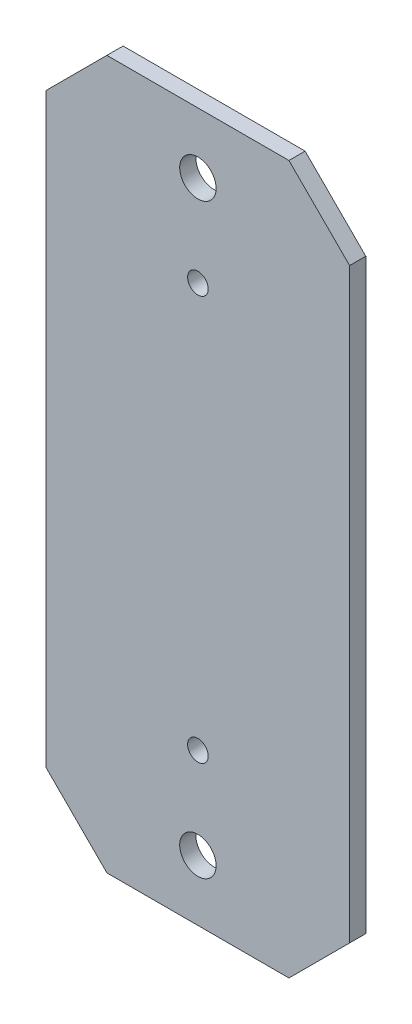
from build123d import *

# Parameters (mm, degrees)
EXTRUSION1_DEPTH       = 8
CHANFREIN1_SIZE        = 30
TROU_TARAUD_M121_D     = 10.2
TROU_TARAUD_M121_DEPTH = 29.25
TROU_TARAUD_M121_TIP   = 3.064389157


with BuildPart() as part:
    # Esquisse1 → Extrusion1 (new body)
    with BuildSketch(Plane.XY):
        with BuildLine():
            Line((0, 0), (75, 175))
            Line((75, 175), (0, 175))
            Line((0, 175), (0, 154))
            ThreePointArc((0, 154), (6.363961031, 151.363961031), (9, 145))
            ThreePointArc((9, 145), (6.363961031, 138.636038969), (0, 136))
            Line((0, 136), (0, 0))
        make_face()
        with BuildLine():
            Line((-75, 175), (0, 0))
            Line((0, 0), (0, 136))
            ThreePointArc((0, 136), (-9, 145), (0, 154))
            Line((0, 154), (0, 175))
            Line((0, 175), (-75, 175))
        make_face()
        Polygon((-75, 0), (0, 0), (-75, 175), align=None)
        Polygon((-75, -175), (0, 0), (-75, 0), align=None)
        with BuildLine():
            Line((0, -136), (0, 0))
            Line((0, 0), (-75, -175))
            Line((-75, -175), (0, -175))
            Line((0, -175), (0, -154))
            ThreePointArc((0, -154), (-9, -145), (0, -136))
        make_face()
        with BuildLine():
            Line((75, -175), (0, 0))
            Line((0, 0), (0, -136))
            ThreePointArc((0, -136), (6.363961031, -138.636038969), (9, -145))
            ThreePointArc((9, -145), (6.363961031, -151.363961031), (0, -154))
            Line((0, -154), (0, -175))
            Line((0, -175), (75, -175))
        make_face()
        Polygon((75, 0), (0, 0), (75, -175), align=None)
        Polygon((75, 0), (75, 175), (0, 0), align=None)
    extrude(amount=EXTRUSION1_DEPTH)

    # Chanfrein1
    chanfrein1_edges = [part.edges().sort_by_distance(p)[0] for p in [
        (-75, 175, 4),
        (75, 175, 4),
        (75, -175, 4),
        (-75, -175, 4),
    ]]
    chamfer(chanfrein1_edges, length=CHANFREIN1_SIZE)

    # Trou taraud_ M121
    with Locations(Plane(origin=(0, -100, 0), x_dir=(-1, 0, 0), z_dir=(0, 0, -1))):
        with Locations((0, 0), (0, 200)):
            Hole(TROU_TARAUD_M121_D / 2, depth=TROU_TARAUD_M121_DEPTH)
            with Locations((0, 0, -(TROU_TARAUD_M121_DEPTH + TROU_TARAUD_M121_TIP / 2))):  # 118° drill point
                Cone(0, TROU_TARAUD_M121_D / 2, TROU_TARAUD_M121_TIP, mode=Mode.SUBTRACT)


solid = part.part
